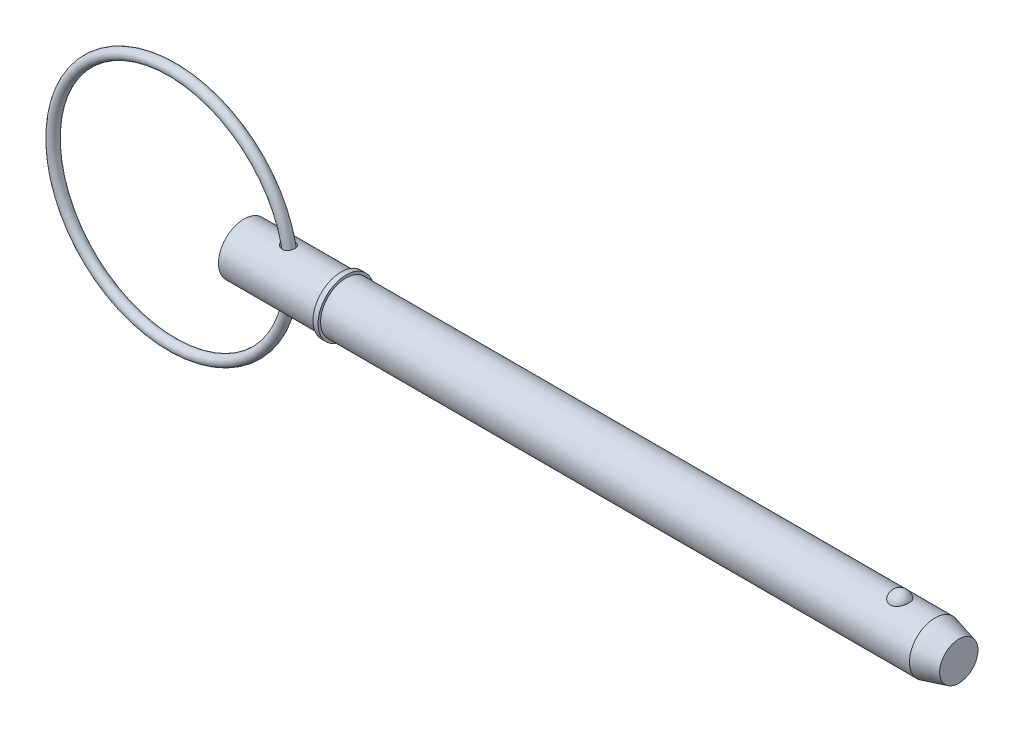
ISO-10303-21;
HEADER;
FILE_DESCRIPTION(('STEP AP214'),'2;1');
FILE_NAME('part.step','',(''),(''),'','','');
FILE_SCHEMA(('AUTOMOTIVE_DESIGN { 1 0 10303 214 1 1 1 1 }'));
ENDSEC;
DATA;
#1=APPLICATION_CONTEXT('core data for automotive mechanical design processes');
#2=APPLICATION_PROTOCOL_DEFINITION('international standard','automotive_design',2000,#1);
#3=PRODUCT_CONTEXT('',#1,'mechanical');
#4=PRODUCT('Part','Part','',(#3));
#5=PRODUCT_RELATED_PRODUCT_CATEGORY('part','',(#4));
#6=PRODUCT_DEFINITION_FORMATION('','',#4);
#7=PRODUCT_DEFINITION_CONTEXT('part definition',#1,'design');
#8=PRODUCT_DEFINITION('design','',#6,#7);
#9=PRODUCT_DEFINITION_SHAPE('','',#8);
#10=(LENGTH_UNIT() NAMED_UNIT(*) SI_UNIT(.MILLI.,.METRE.));
#11=(NAMED_UNIT(*) PLANE_ANGLE_UNIT() SI_UNIT($,.RADIAN.));
#12=(NAMED_UNIT(*) SI_UNIT($,.STERADIAN.) SOLID_ANGLE_UNIT());
#13=UNCERTAINTY_MEASURE_WITH_UNIT(LENGTH_MEASURE(1.E-05),#10,'distance_accuracy_value','');
#14=(GEOMETRIC_REPRESENTATION_CONTEXT(3) GLOBAL_UNCERTAINTY_ASSIGNED_CONTEXT((#13)) GLOBAL_UNIT_ASSIGNED_CONTEXT((#10,
#11,#12)) REPRESENTATION_CONTEXT('',''));
#15=CARTESIAN_POINT('',(0.,0.,0.));
#16=DIRECTION('',(0.,0.,1.));
#17=DIRECTION('',(1.,0.,0.));
#18=AXIS2_PLACEMENT_3D('',#15,#16,#17);
#19=CARTESIAN_POINT('',(-13.4013067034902,0.,0.));
#20=DIRECTION('',(0.,0.,1.));
#21=DIRECTION('',(1.,0.,0.));
#22=AXIS2_PLACEMENT_3D('',#19,#20,#21);
#23=TOROIDAL_SURFACE('',#22,22.225,0.952999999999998);
#24=CARTESIAN_POINT('',(9.77669329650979,0.,0.));
#25=VERTEX_POINT('',#24);
#26=VERTEX_LOOP('',#25);
#27=FACE_BOUND('',#26,.T.);
#28=ADVANCED_FACE('P0_F12',(#27),#23,.T.);
#29=CLOSED_SHELL('',(#28));
#30=MANIFOLD_SOLID_BREP('P0_B1',#29);
#31=CARTESIAN_POINT('',(0.,0.,0.));
#32=DIRECTION('',(1.,0.,0.));
#33=DIRECTION('',(0.,0.,-1.));
#34=AXIS2_PLACEMENT_3D('',#31,#32,#33);
#35=CYLINDRICAL_SURFACE('',#34,4.765);
#36=CARTESIAN_POINT('',(7.48459594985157,4.685973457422,-0.864220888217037));
#37=CARTESIAN_POINT('',(7.53849733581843,4.67711144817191,-0.912273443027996));
#38=CARTESIAN_POINT('',(7.59654891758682,4.66833039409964,-0.955745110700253));
#39=CARTESIAN_POINT('',(7.71924602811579,4.65195567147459,-1.03251233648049));
#40=CARTESIAN_POINT('',(7.78389917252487,4.64436340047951,-1.06579596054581));
#41=CARTESIAN_POINT('',(7.91808098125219,4.63129108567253,-1.12124172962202));
#42=CARTESIAN_POINT('',(7.98761280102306,4.62581242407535,-1.14339659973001));
#43=CARTESIAN_POINT('',(8.12956198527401,4.61771699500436,-1.17566870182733));
#44=CARTESIAN_POINT('',(8.20197774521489,4.61509865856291,-1.18579253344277));
#45=CARTESIAN_POINT('',(8.34550810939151,4.6131791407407,-1.19323853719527));
#46=CARTESIAN_POINT('',(8.41660306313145,4.61378793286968,-1.19090812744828));
#47=CARTESIAN_POINT('',(8.55721866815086,4.61812874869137,-1.17396277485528));
#48=CARTESIAN_POINT('',(8.62673979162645,4.62185982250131,-1.15935156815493));
#49=CARTESIAN_POINT('',(8.75801373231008,4.63172632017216,-1.11925454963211));
#50=CARTESIAN_POINT('',(8.81998342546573,4.63771186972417,-1.09443918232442));
#51=CARTESIAN_POINT('',(8.93863698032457,4.65140179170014,-1.03470792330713));
#52=CARTESIAN_POINT('',(8.99532131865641,4.65910600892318,-0.999792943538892));
#53=CARTESIAN_POINT('',(9.10080884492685,4.67519705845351,-0.921583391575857));
#54=CARTESIAN_POINT('',(9.14973848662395,4.68356861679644,-0.878455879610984));
#55=CARTESIAN_POINT('',(9.23971126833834,4.70019813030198,-0.784620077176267));
#56=CARTESIAN_POINT('',(9.28075401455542,4.7084560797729,-0.733911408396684));
#57=CARTESIAN_POINT('',(9.35441071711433,4.7240688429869,-0.62563775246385));
#58=CARTESIAN_POINT('',(9.38691359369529,4.73141115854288,-0.567995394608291));
#59=CARTESIAN_POINT('',(9.44203216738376,4.74427907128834,-0.447974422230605));
#60=CARTESIAN_POINT('',(9.46464743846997,4.74980459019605,-0.385595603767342));
#61=CARTESIAN_POINT('',(9.49961110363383,4.75848927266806,-0.257248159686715));
#62=CARTESIAN_POINT('',(9.51186382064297,4.76162635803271,-0.191251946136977));
#63=CARTESIAN_POINT('',(9.52545294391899,4.76511165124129,-0.0580729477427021));
#64=CARTESIAN_POINT('',(9.52678936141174,4.76545986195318,0.00910983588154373));
#65=CARTESIAN_POINT('',(9.51851557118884,4.76333054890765,0.142723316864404));
#66=CARTESIAN_POINT('',(9.50891008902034,4.76085424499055,0.209154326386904));
#67=CARTESIAN_POINT('',(9.47899306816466,4.75334441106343,0.339411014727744));
#68=CARTESIAN_POINT('',(9.45868126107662,4.74831081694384,0.403236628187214));
#69=CARTESIAN_POINT('',(9.4078294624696,4.73622777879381,0.526509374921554));
#70=CARTESIAN_POINT('',(9.37728413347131,4.72917728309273,0.585954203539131));
#71=CARTESIAN_POINT('',(9.30671117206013,4.71383320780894,0.698745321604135));
#72=CARTESIAN_POINT('',(9.26668347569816,4.70553961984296,0.752091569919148));
#73=CARTESIAN_POINT('',(9.17821531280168,4.68864637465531,0.851083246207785));
#74=CARTESIAN_POINT('',(9.12978756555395,4.68004719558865,0.896740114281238));
#75=CARTESIAN_POINT('',(9.02575872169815,4.66350833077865,0.97912505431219));
#76=CARTESIAN_POINT('',(8.97015856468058,4.65556855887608,1.01585429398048));
#77=CARTESIAN_POINT('',(8.85409306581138,4.6413534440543,1.0789347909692));
#78=CARTESIAN_POINT('',(8.79369898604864,4.63505812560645,1.10541268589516));
#79=CARTESIAN_POINT('',(8.66918290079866,4.62469916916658,1.1479836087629));
#80=CARTESIAN_POINT('',(8.60506121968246,4.62063533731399,1.1640775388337));
#81=CARTESIAN_POINT('',(8.47537782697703,4.61517348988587,1.18554696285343));
#82=CARTESIAN_POINT('',(8.4098281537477,4.61375835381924,1.19099130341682));
#83=CARTESIAN_POINT('',(8.2786938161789,4.61362908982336,1.19149080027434));
#84=CARTESIAN_POINT('',(8.21310914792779,4.61491539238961,1.18654430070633));
#85=CARTESIAN_POINT('',(8.08152457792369,4.62006017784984,1.16635311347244));
#86=CARTESIAN_POINT('',(8.01557748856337,4.62399895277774,1.15078675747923));
#87=CARTESIAN_POINT('',(7.88704537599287,4.63403793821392,1.10966738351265));
#88=CARTESIAN_POINT('',(7.82446148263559,4.64013886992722,1.08411103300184));
#89=CARTESIAN_POINT('',(7.70057947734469,4.65423592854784,1.02195168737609));
#90=CARTESIAN_POINT('',(7.63957197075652,4.66232221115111,0.984788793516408));
#91=CARTESIAN_POINT('',(7.52457021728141,4.67924552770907,0.900950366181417));
#92=CARTESIAN_POINT('',(7.47057819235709,4.68808279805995,0.854271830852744));
#93=CARTESIAN_POINT('',(7.37028930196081,4.70567913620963,0.751386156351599));
#94=CARTESIAN_POINT('',(7.32416327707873,4.7144333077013,0.695010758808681));
#95=CARTESIAN_POINT('',(7.24276674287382,4.73060166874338,0.574719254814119));
#96=CARTESIAN_POINT('',(7.20749051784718,4.73801656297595,0.510807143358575));
#97=CARTESIAN_POINT('',(7.15148495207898,4.75009927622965,0.381705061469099));
#98=CARTESIAN_POINT('',(7.12994463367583,4.7549169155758,0.31688231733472));
#99=CARTESIAN_POINT('',(7.09904467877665,4.76189692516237,0.184270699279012));
#100=CARTESIAN_POINT('',(7.08967554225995,4.76406136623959,0.116484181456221));
#101=CARTESIAN_POINT('',(7.08394150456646,4.76538257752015,-0.0133529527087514));
#102=CARTESIAN_POINT('',(7.0864533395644,4.76479916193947,-0.0753538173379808));
#103=CARTESIAN_POINT('',(7.10181380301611,4.76127985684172,-0.197993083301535));
#104=CARTESIAN_POINT('',(7.11466291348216,4.75834385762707,-0.258631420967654));
#105=CARTESIAN_POINT('',(7.14973937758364,4.75051877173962,-0.375744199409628));
#106=CARTESIAN_POINT('',(7.17178938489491,4.7456667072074,-0.432274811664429));
#107=CARTESIAN_POINT('',(7.22432962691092,4.73449674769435,-0.54107038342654));
#108=CARTESIAN_POINT('',(7.25481702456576,4.72817934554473,-0.593336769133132));
#109=CARTESIAN_POINT('',(7.31700895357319,4.71588241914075,-0.683642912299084));
#110=CARTESIAN_POINT('',(7.34750058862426,4.7100477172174,-0.722547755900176));
#111=CARTESIAN_POINT('',(7.41288050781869,4.69812059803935,-0.796421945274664));
#112=CARTESIAN_POINT('',(7.44776960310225,4.69202813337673,-0.831390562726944));
#113=CARTESIAN_POINT('',(7.48459594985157,4.685973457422,-0.864220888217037));
#114=B_SPLINE_CURVE_WITH_KNOTS('',3,(#36,#37,#38,#39,#40,#41,#42,#43,#44,#45,#46,#47,#48,#49,
#50,#51,#52,#53,#54,#55,#56,#57,#58,#59,#60,#61,#62,#63,#64,#65,#66,#67,#68,#69,#70,#71,#72,#73,
#74,#75,#76,#77,#78,#79,#80,#81,#82,#83,#84,#85,#86,#87,#88,#89,#90,#91,#92,#93,#94,#95,#96,#97,
#98,#99,#100,#101,#102,#103,#104,#105,#106,#107,#108,#109,#110,#111,#112,#113),.UNSPECIFIED.,
.T.,.F.,(4,2,2,2,2,2,2,2,2,2,2,2,2,2,2,2,2,2,2,2,2,2,2,2,2,2,2,2,2,2,2,2,2,2,2,2,2,2,4),(0.,
0.218078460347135,0.436411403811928,0.654886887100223,0.873242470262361,1.08553925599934,
1.2977714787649,1.49785367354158,1.6979178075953,1.8942789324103,2.09064985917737,
2.28946102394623,2.48828075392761,2.68891673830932,2.88955251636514,3.09010167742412,
3.29065586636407,3.49131482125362,3.69197512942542,3.89233421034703,4.09266707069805,
4.29043955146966,4.48819484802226,4.68466743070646,4.8811713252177,5.08390806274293,
5.28671248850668,5.50140943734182,5.71617422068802,5.93513249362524,6.15397522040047,
6.35827356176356,6.56241234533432,6.74765856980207,6.93291343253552,7.11475139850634,
7.29652829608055,7.44549570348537,7.59449062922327),.UNSPECIFIED.);
#115=CARTESIAN_POINT('',(7.48459594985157,4.685973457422,-0.864220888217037));
#116=VERTEX_POINT('',#115);
#117=EDGE_CURVE('P1_E42',#116,#116,#114,.T.);
#118=ORIENTED_EDGE('',*,*,#117,.T.);
#119=EDGE_LOOP('',(#118));
#120=FACE_BOUND('',#119,.T.);
#121=CARTESIAN_POINT('',(0.,0.,0.));
#122=DIRECTION('',(1.,0.,0.));
#123=DIRECTION('',(0.,0.,-1.));
#124=AXIS2_PLACEMENT_3D('',#121,#122,#123);
#125=CIRCLE('',#124,4.765);
#126=CARTESIAN_POINT('',(0.,0.,-4.765));
#127=VERTEX_POINT('',#126);
#128=EDGE_CURVE('P1_E9',#127,#127,#125,.T.);
#129=ORIENTED_EDGE('',*,*,#128,.T.);
#130=EDGE_LOOP('',(#129));
#131=FACE_BOUND('',#130,.T.);
#132=CARTESIAN_POINT('',(18.097,0.,0.));
#133=DIRECTION('',(1.,0.,0.));
#134=DIRECTION('',(0.,0.,-1.));
#135=AXIS2_PLACEMENT_3D('',#132,#133,#134);
#136=CIRCLE('',#135,4.765);
#137=CARTESIAN_POINT('',(18.097,0.,-4.765));
#138=VERTEX_POINT('',#137);
#139=EDGE_CURVE('P1_E25',#138,#138,#136,.T.);
#140=ORIENTED_EDGE('',*,*,#139,.F.);
#141=EDGE_LOOP('',(#140));
#142=FACE_BOUND('',#141,.T.);
#143=CARTESIAN_POINT('',(7.48459594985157,-4.685973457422,-0.864220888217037));
#144=CARTESIAN_POINT('',(7.43440944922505,-4.6942250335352,-0.819477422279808));
#145=CARTESIAN_POINT('',(7.38778663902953,-4.70255210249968,-0.77073361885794));
#146=CARTESIAN_POINT('',(7.3030968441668,-4.7184989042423,-0.666172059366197));
#147=CARTESIAN_POINT('',(7.26503010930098,-4.72611861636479,-0.610354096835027));
#148=CARTESIAN_POINT('',(7.19878266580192,-4.73983819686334,-0.492624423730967));
#149=CARTESIAN_POINT('',(7.17064194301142,-4.74593188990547,-0.430689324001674));
#150=CARTESIAN_POINT('',(7.12584349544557,-4.75581281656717,-0.3026233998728));
#151=CARTESIAN_POINT('',(7.10917889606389,-4.75960143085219,-0.236495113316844));
#152=CARTESIAN_POINT('',(7.0889853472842,-4.76421379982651,-0.106818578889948));
#153=CARTESIAN_POINT('',(7.0846333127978,-4.76522320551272,-0.0434047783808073));
#154=CARTESIAN_POINT('',(7.08693064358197,-4.7646936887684,0.0832041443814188));
#155=CARTESIAN_POINT('',(7.09357756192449,-4.76315533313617,0.146399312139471));
#156=CARTESIAN_POINT('',(7.11694629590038,-4.75784365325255,0.267709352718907));
#157=CARTESIAN_POINT('',(7.13318365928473,-4.75417793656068,0.325923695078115));
#158=CARTESIAN_POINT('',(7.17459606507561,-4.74508048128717,0.438922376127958));
#159=CARTESIAN_POINT('',(7.19977257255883,-4.73964845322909,0.493706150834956));
#160=CARTESIAN_POINT('',(7.25946789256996,-4.72725615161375,0.60111049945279));
#161=CARTESIAN_POINT('',(7.2943661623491,-4.72023663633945,0.653512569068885));
#162=CARTESIAN_POINT('',(7.37173226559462,-4.70550732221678,0.752279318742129));
#163=CARTESIAN_POINT('',(7.41420315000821,-4.69779724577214,0.798641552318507));
#164=CARTESIAN_POINT('',(7.50982312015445,-4.6816641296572,0.888551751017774));
#165=CARTESIAN_POINT('',(7.56359853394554,-4.67324162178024,0.931434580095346));
#166=CARTESIAN_POINT('',(7.67736628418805,-4.65728554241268,1.00819498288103));
#167=CARTESIAN_POINT('',(7.7373611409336,-4.64975233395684,1.04206888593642));
#168=CARTESIAN_POINT('',(7.86574076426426,-4.63599923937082,1.10169445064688));
#169=CARTESIAN_POINT('',(7.93441048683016,-4.62988111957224,1.12685968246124));
#170=CARTESIAN_POINT('',(8.07519000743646,-4.62035710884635,1.16529928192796));
#171=CARTESIAN_POINT('',(8.14729925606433,-4.61695078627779,1.1785755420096));
#172=CARTESIAN_POINT('',(8.29111621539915,-4.61341807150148,1.19232949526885));
#173=CARTESIAN_POINT('',(8.36279361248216,-4.61321655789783,1.19310032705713));
#174=CARTESIAN_POINT('',(8.50512944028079,-4.61602317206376,1.1821962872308));
#175=CARTESIAN_POINT('',(8.57578827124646,-4.61903000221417,1.17052644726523));
#176=CARTESIAN_POINT('',(8.70965757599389,-4.62766311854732,1.13589249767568));
#177=CARTESIAN_POINT('',(8.77306169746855,-4.63312492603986,1.11363308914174));
#178=CARTESIAN_POINT('',(8.8949702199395,-4.64598463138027,1.05869880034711));
#179=CARTESIAN_POINT('',(8.95347516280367,-4.65338231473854,1.02602507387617));
#180=CARTESIAN_POINT('',(9.06253415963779,-4.66906009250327,0.952097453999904));
#181=CARTESIAN_POINT('',(9.11324728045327,-4.67731427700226,0.911072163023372));
#182=CARTESIAN_POINT('',(9.20707850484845,-4.69393979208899,0.821122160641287));
#183=CARTESIAN_POINT('',(9.25019629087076,-4.70231112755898,0.772197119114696));
#184=CARTESIAN_POINT('',(9.32819072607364,-4.71835356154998,0.667239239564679));
#185=CARTESIAN_POINT('',(9.36297449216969,-4.72601623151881,0.611136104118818));
#186=CARTESIAN_POINT('',(9.42286382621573,-4.73971239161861,0.493799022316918));
#187=CARTESIAN_POINT('',(9.44796891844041,-4.74574580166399,0.432564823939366));
#188=CARTESIAN_POINT('',(9.48811605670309,-4.75559286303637,0.305990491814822));
#189=CARTESIAN_POINT('',(9.50304870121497,-4.75938232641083,0.240613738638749));
#190=CARTESIAN_POINT('',(9.5220569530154,-4.76423188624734,0.108201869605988));
#191=CARTESIAN_POINT('',(9.52613255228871,-4.76529198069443,0.0411667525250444));
#192=CARTESIAN_POINT('',(9.52332772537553,-4.76456884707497,-0.0926701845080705));
#193=CARTESIAN_POINT('',(9.51644541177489,-4.76278512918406,-0.159471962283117));
#194=CARTESIAN_POINT('',(9.49188827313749,-4.75656536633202,-0.290934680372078));
#195=CARTESIAN_POINT('',(9.47421322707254,-4.75212926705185,-0.355595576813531));
#196=CARTESIAN_POINT('',(9.42849503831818,-4.74108318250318,-0.480955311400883));
#197=CARTESIAN_POINT('',(9.4004503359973,-4.73447287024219,-0.541653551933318));
#198=CARTESIAN_POINT('',(9.33467290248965,-4.71979928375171,-0.657361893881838));
#199=CARTESIAN_POINT('',(9.29694000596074,-4.71173598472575,-0.712371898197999));
#200=CARTESIAN_POINT('',(9.2127449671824,-4.69505469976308,-0.815106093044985));
#201=CARTESIAN_POINT('',(9.1662875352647,-4.68643701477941,-0.862834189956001));
#202=CARTESIAN_POINT('',(9.06584125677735,-4.66961864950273,-0.949656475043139));
#203=CARTESIAN_POINT('',(9.01185326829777,-4.66141792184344,-0.98875164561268));
#204=CARTESIAN_POINT('',(8.8985010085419,-4.64646376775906,-1.0567894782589));
#205=CARTESIAN_POINT('',(8.83920621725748,-4.63969468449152,-1.08584444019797));
#206=CARTESIAN_POINT('',(8.71642097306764,-4.62824519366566,-1.13365785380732));
#207=CARTESIAN_POINT('',(8.65293102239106,-4.623564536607,-1.15241753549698));
#208=CARTESIAN_POINT('',(8.52421291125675,-4.61681938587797,-1.17914952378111));
#209=CARTESIAN_POINT('',(8.45900634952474,-4.6147310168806,-1.18722032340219));
#210=CARTESIAN_POINT('',(8.32811210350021,-4.61325848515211,-1.19292878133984));
#211=CARTESIAN_POINT('',(8.26242433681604,-4.61387479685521,-1.19056460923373));
#212=CARTESIAN_POINT('',(8.13057358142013,-4.6177227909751,-1.17555160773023));
#213=CARTESIAN_POINT('',(8.06444352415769,-4.62102282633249,-1.16263394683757));
#214=CARTESIAN_POINT('',(7.93513143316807,-4.62989870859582,-1.12676570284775));
#215=CARTESIAN_POINT('',(7.87194976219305,-4.6354748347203,-1.10381388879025));
#216=CARTESIAN_POINT('',(7.75155849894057,-4.64811746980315,-1.04928030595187));
#217=CARTESIAN_POINT('',(7.69423767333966,-4.65514232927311,-1.01793362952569));
#218=CARTESIAN_POINT('',(7.58503138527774,-4.67007903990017,-0.947046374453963));
#219=CARTESIAN_POINT('',(7.53314612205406,-4.67799092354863,-0.907505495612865));
#220=CARTESIAN_POINT('',(7.48459594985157,-4.685973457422,-0.864220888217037));
#221=B_SPLINE_CURVE_WITH_KNOTS('',3,(#143,#144,#145,#146,#147,#148,#149,#150,#151,#152,#153,
#154,#155,#156,#157,#158,#159,#160,#161,#162,#163,#164,#165,#166,#167,#168,#169,#170,#171,#172,
#173,#174,#175,#176,#177,#178,#179,#180,#181,#182,#183,#184,#185,#186,#187,#188,#189,#190,#191,
#192,#193,#194,#195,#196,#197,#198,#199,#200,#201,#202,#203,#204,#205,#206,#207,#208,#209,#210,
#211,#212,#213,#214,#215,#216,#217,#218,#219,#220),.UNSPECIFIED.,.T.,.F.,(4,2,2,2,2,2,2,2,2,2,2,
2,2,2,2,2,2,2,2,2,2,2,2,2,2,2,2,2,2,2,2,2,2,2,2,2,2,2,4),(0.,0.203013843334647,
0.406033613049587,0.609862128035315,0.813568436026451,1.0032929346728,1.19297523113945,
1.37380897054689,1.55467236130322,1.74393241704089,1.93326889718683,2.14025373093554,
2.3473227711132,2.566425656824,2.78549366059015,2.9994188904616,3.21325763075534,
3.41451842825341,3.61575693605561,3.81208930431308,4.00842987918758,4.20686629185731,
4.40531245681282,4.60586051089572,4.80640871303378,5.0069914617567,5.20757831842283,
5.40819535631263,5.60881581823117,5.80932827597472,6.00981790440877,6.2079863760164,
6.40613116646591,6.60243714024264,6.79877754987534,7.00028133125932,7.20180983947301,
7.39819723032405,7.59459181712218),.UNSPECIFIED.);
#222=CARTESIAN_POINT('',(7.48459594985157,-4.685973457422,-0.864220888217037));
#223=VERTEX_POINT('',#222);
#224=EDGE_CURVE('P1_E17',#223,#223,#221,.T.);
#225=ORIENTED_EDGE('',*,*,#224,.T.);
#226=EDGE_LOOP('',(#225));
#227=FACE_BOUND('',#226,.T.);
#228=ADVANCED_FACE('P1_F13',(#120,#131,#142,#227),#35,.T.);
#229=CARTESIAN_POINT('',(0.,0.,0.));
#230=DIRECTION('',(1.,0.,0.));
#231=DIRECTION('',(0.,0.,-1.));
#232=AXIS2_PLACEMENT_3D('',#229,#230,#231);
#233=CYLINDRICAL_SURFACE('',#232,4.765);
#234=CARTESIAN_POINT('',(128.904194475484,0.,0.));
#235=DIRECTION('',(1.,0.,0.));
#236=DIRECTION('',(0.,0.,-1.));
#237=AXIS2_PLACEMENT_3D('',#234,#235,#236);
#238=CIRCLE('',#237,4.765);
#239=CARTESIAN_POINT('',(128.904194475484,0.,-4.765));
#240=VERTEX_POINT('',#239);
#241=EDGE_CURVE('P1_E99',#240,#240,#238,.T.);
#242=ORIENTED_EDGE('',*,*,#241,.F.);
#243=EDGE_LOOP('',(#242));
#244=FACE_BOUND('',#243,.T.);
#245=CARTESIAN_POINT('',(19.05,0.,0.));
#246=DIRECTION('',(1.,0.,0.));
#247=DIRECTION('',(0.,0.,-1.));
#248=AXIS2_PLACEMENT_3D('',#245,#246,#247);
#249=CIRCLE('',#248,4.765);
#250=CARTESIAN_POINT('',(19.05,0.,-4.765));
#251=VERTEX_POINT('',#250);
#252=EDGE_CURVE('P1_E96',#251,#251,#249,.T.);
#253=ORIENTED_EDGE('',*,*,#252,.T.);
#254=EDGE_LOOP('',(#253));
#255=FACE_BOUND('',#254,.T.);
#256=CARTESIAN_POINT('',(122.351020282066,4.42764777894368,1.76101111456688));
#257=CARTESIAN_POINT('',(122.259721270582,4.42764470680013,1.76101422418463));
#258=CARTESIAN_POINT('',(122.168446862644,4.43059091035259,1.75366340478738));
#259=CARTESIAN_POINT('',(121.988615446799,4.44201846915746,1.72451180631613));
#260=CARTESIAN_POINT('',(121.900057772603,4.45049845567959,1.70271460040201));
#261=CARTESIAN_POINT('',(121.728257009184,4.47200516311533,1.6453937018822));
#262=CARTESIAN_POINT('',(121.645006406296,4.48502527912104,1.60988994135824));
#263=CARTESIAN_POINT('',(121.485763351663,4.51419542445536,1.52617873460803));
#264=CARTESIAN_POINT('',(121.409772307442,4.53034605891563,1.47796883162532));
#265=CARTESIAN_POINT('',(121.264744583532,4.5645931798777,1.36860494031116));
#266=CARTESIAN_POINT('',(121.195964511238,4.58273170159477,1.30712420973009));
#267=CARTESIAN_POINT('',(121.069342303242,4.61870302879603,1.1737020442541));
#268=CARTESIAN_POINT('',(121.011502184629,4.63653577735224,1.1017586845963));
#269=CARTESIAN_POINT('',(120.905570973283,4.67090140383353,0.945806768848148));
#270=CARTESIAN_POINT('',(120.858030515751,4.68734068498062,0.861402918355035));
#271=CARTESIAN_POINT('',(120.777081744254,4.71628466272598,0.68544236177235));
#272=CARTESIAN_POINT('',(120.743674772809,4.72878898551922,0.59388497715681));
#273=CARTESIAN_POINT('',(120.691287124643,4.74874061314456,0.404781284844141));
#274=CARTESIAN_POINT('',(120.672517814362,4.75611366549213,0.307168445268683));
#275=CARTESIAN_POINT('',(120.650584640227,4.76475393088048,0.109940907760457));
#276=CARTESIAN_POINT('',(120.647420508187,4.76602124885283,0.010326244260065));
#277=CARTESIAN_POINT('',(120.656740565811,4.76232928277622,-0.18762912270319));
#278=CARTESIAN_POINT('',(120.669158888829,4.7573962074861,-0.285973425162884));
#279=CARTESIAN_POINT('',(120.709280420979,4.74184975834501,-0.479027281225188));
#280=CARTESIAN_POINT('',(120.736983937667,4.7312362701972,-0.573736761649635));
#281=CARTESIAN_POINT('',(120.807158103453,4.70540026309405,-0.756973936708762));
#282=CARTESIAN_POINT('',(120.849646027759,4.69017235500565,-0.845494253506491));
#283=CARTESIAN_POINT('',(120.948520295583,4.6566986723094,-1.01378033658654));
#284=CARTESIAN_POINT('',(121.004907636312,4.63845268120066,-1.09354547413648));
#285=CARTESIAN_POINT('',(121.130552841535,4.60085438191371,-1.24228523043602));
#286=CARTESIAN_POINT('',(121.199843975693,4.58149930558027,-1.31123108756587));
#287=CARTESIAN_POINT('',(121.349606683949,4.54391653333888,-1.43607409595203));
#288=CARTESIAN_POINT('',(121.430077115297,4.52568872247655,-1.49197257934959));
#289=CARTESIAN_POINT('',(121.598150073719,4.49293007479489,-1.58786764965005));
#290=CARTESIAN_POINT('',(121.685544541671,4.47832346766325,-1.62820219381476));
#291=CARTESIAN_POINT('',(121.866553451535,4.45406011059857,-1.69345757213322));
#292=CARTESIAN_POINT('',(121.96016555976,4.44440151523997,-1.71838415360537));
#293=CARTESIAN_POINT('',(122.145893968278,4.43159888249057,-1.75112843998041));
#294=CARTESIAN_POINT('',(122.237849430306,4.42815213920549,-1.75974223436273));
#295=CARTESIAN_POINT('',(122.421965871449,4.427247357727,-1.76201865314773));
#296=CARTESIAN_POINT('',(122.514126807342,4.42978816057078,-1.7556841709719));
#297=CARTESIAN_POINT('',(122.693129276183,4.4403864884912,-1.72869560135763));
#298=CARTESIAN_POINT('',(122.780047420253,4.44827555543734,-1.70847853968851));
#299=CARTESIAN_POINT('',(122.949131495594,4.46852246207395,-1.65479562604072));
#300=CARTESIAN_POINT('',(123.031297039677,4.48088066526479,-1.62132869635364));
#301=CARTESIAN_POINT('',(123.190591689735,4.50907357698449,-1.54120560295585));
#302=CARTESIAN_POINT('',(123.267570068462,4.52497884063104,-1.49427526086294));
#303=CARTESIAN_POINT('',(123.412708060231,4.55845148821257,-1.38881222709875));
#304=CARTESIAN_POINT('',(123.480865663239,4.57601924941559,-1.33027689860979));
#305=CARTESIAN_POINT('',(123.610099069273,4.61196537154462,-1.19991049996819));
#306=CARTESIAN_POINT('',(123.670656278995,4.63034074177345,-1.12756415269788));
#307=CARTESIAN_POINT('',(123.779279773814,4.66513959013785,-0.973612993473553));
#308=CARTESIAN_POINT('',(123.827343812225,4.68156271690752,-0.892006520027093));
#309=CARTESIAN_POINT('',(123.911383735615,4.71130224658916,-0.718892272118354));
#310=CARTESIAN_POINT('',(123.946918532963,4.724501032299,-0.627149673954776));
#311=CARTESIAN_POINT('',(124.002952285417,4.74571823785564,-0.438611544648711));
#312=CARTESIAN_POINT('',(124.023450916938,4.75373654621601,-0.341815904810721));
#313=CARTESIAN_POINT('',(124.049033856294,4.76378905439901,-0.145633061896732));
#314=CARTESIAN_POINT('',(124.054076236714,4.76580697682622,-0.0462395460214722));
#315=CARTESIAN_POINT('',(124.048523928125,4.76360573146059,0.15203857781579));
#316=CARTESIAN_POINT('',(124.037929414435,4.75938663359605,0.250923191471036));
#317=CARTESIAN_POINT('',(124.001387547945,4.74516937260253,0.445004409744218));
#318=CARTESIAN_POINT('',(123.975496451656,4.73519238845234,0.540213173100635));
#319=CARTESIAN_POINT('',(123.908927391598,4.7104939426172,0.724662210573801));
#320=CARTESIAN_POINT('',(123.868248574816,4.69577220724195,0.813902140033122));
#321=CARTESIAN_POINT('',(123.772717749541,4.66303767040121,0.984313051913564));
#322=CARTESIAN_POINT('',(123.717804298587,4.64501070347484,1.06544688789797));
#323=CARTESIAN_POINT('',(123.595049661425,4.60764678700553,1.21692673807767));
#324=CARTESIAN_POINT('',(123.527208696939,4.58830985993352,1.2872729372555));
#325=CARTESIAN_POINT('',(123.380548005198,4.55060370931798,1.41479271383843));
#326=CARTESIAN_POINT('',(123.301791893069,4.53222967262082,1.47203785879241));
#327=CARTESIAN_POINT('',(123.134989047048,4.49849576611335,1.57212016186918));
#328=CARTESIAN_POINT('',(123.046941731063,4.48313608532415,1.61495641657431));
#329=CARTESIAN_POINT('',(122.859791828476,4.45676184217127,1.68642657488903));
#330=CARTESIAN_POINT('',(122.760365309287,4.44598302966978,1.71430590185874));
#331=CARTESIAN_POINT('',(122.557621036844,4.43142918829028,1.7515925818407));
#332=CARTESIAN_POINT('',(122.454304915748,4.42765125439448,1.76100759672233));
#333=CARTESIAN_POINT('',(122.351020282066,4.42764777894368,1.76101111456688));
#334=B_SPLINE_CURVE_WITH_KNOTS('',3,(#256,#257,#258,#259,#260,#261,#262,#263,#264,#265,#266,
#267,#268,#269,#270,#271,#272,#273,#274,#275,#276,#277,#278,#279,#280,#281,#282,#283,#284,#285,
#286,#287,#288,#289,#290,#291,#292,#293,#294,#295,#296,#297,#298,#299,#300,#301,#302,#303,#304,
#305,#306,#307,#308,#309,#310,#311,#312,#313,#314,#315,#316,#317,#318,#319,#320,#321,#322,#323,
#324,#325,#326,#327,#328,#329,#330,#331,#332,#333),.UNSPECIFIED.,.T.,.F.,(4,2,2,2,2,2,2,2,2,2,2,
2,2,2,2,2,2,2,2,2,2,2,2,2,2,2,2,2,2,2,2,2,2,2,2,2,2,2,4),(0.,0.273517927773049,
0.546968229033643,0.820022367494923,1.09312934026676,1.37393946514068,1.65480131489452,
1.94820420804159,2.24163496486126,2.53922817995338,2.8368162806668,3.13315071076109,
3.42949110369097,3.72617893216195,4.02288805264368,4.32037303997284,4.61782764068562,
4.90840095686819,5.19886582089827,5.47474855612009,5.75057789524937,6.01809977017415,
6.28564340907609,6.55907787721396,6.83257454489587,7.11962987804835,7.40673679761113,
7.70312663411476,7.99952284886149,8.29672237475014,8.59391856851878,8.89002850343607,
9.18615552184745,9.48358266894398,9.78100471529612,10.0767610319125,10.3725358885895,
10.6820893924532,10.991514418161),.UNSPECIFIED.);
#335=CARTESIAN_POINT('',(122.351020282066,4.42764777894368,1.76101111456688));
#336=VERTEX_POINT('',#335);
#337=EDGE_CURVE('P1_E34',#336,#336,#334,.T.);
#338=ORIENTED_EDGE('',*,*,#337,.T.);
#339=EDGE_LOOP('',(#338));
#340=FACE_BOUND('',#339,.T.);
#341=ADVANCED_FACE('P1_F46',(#244,#255,#340),#233,.T.);
#342=CARTESIAN_POINT('',(0.,0.,0.));
#343=DIRECTION('',(-1.,0.,0.));
#344=DIRECTION('',(0.,0.,1.));
#345=AXIS2_PLACEMENT_3D('',#342,#343,#344);
#346=PLANE('',#345);
#347=ORIENTED_EDGE('',*,*,#128,.F.);
#348=EDGE_LOOP('',(#347));
#349=FACE_BOUND('',#348,.T.);
#350=ADVANCED_FACE('P1_F15',(#349),#346,.T.);
#351=CARTESIAN_POINT('',(18.097,4.765,0.));
#352=DIRECTION('',(-1.,0.,0.));
#353=DIRECTION('',(0.,0.,1.));
#354=AXIS2_PLACEMENT_3D('',#351,#352,#353);
#355=PLANE('',#354);
#356=ORIENTED_EDGE('',*,*,#139,.T.);
#357=EDGE_LOOP('',(#356));
#358=FACE_BOUND('',#357,.T.);
#359=CARTESIAN_POINT('',(18.097,0.,0.));
#360=DIRECTION('',(1.,0.,0.));
#361=DIRECTION('',(0.,0.,-1.));
#362=AXIS2_PLACEMENT_3D('',#359,#360,#361);
#363=CIRCLE('',#362,5.2415);
#364=CARTESIAN_POINT('',(18.097,0.,-5.2415));
#365=VERTEX_POINT('',#364);
#366=EDGE_CURVE('P1_E30',#365,#365,#363,.T.);
#367=ORIENTED_EDGE('',*,*,#366,.F.);
#368=EDGE_LOOP('',(#367));
#369=FACE_BOUND('',#368,.T.);
#370=ADVANCED_FACE('P1_F81',(#358,#369),#355,.T.);
#371=CARTESIAN_POINT('',(0.,0.,0.));
#372=DIRECTION('',(1.,0.,0.));
#373=DIRECTION('',(0.,0.,-1.));
#374=AXIS2_PLACEMENT_3D('',#371,#372,#373);
#375=CYLINDRICAL_SURFACE('',#374,5.2415);
#376=ORIENTED_EDGE('',*,*,#366,.T.);
#377=EDGE_LOOP('',(#376));
#378=FACE_BOUND('',#377,.T.);
#379=CARTESIAN_POINT('',(19.05,0.,0.));
#380=DIRECTION('',(1.,0.,0.));
#381=DIRECTION('',(0.,0.,-1.));
#382=AXIS2_PLACEMENT_3D('',#379,#380,#381);
#383=CIRCLE('',#382,5.2415);
#384=CARTESIAN_POINT('',(19.05,0.,-5.2415));
#385=VERTEX_POINT('',#384);
#386=EDGE_CURVE('P1_E95',#385,#385,#383,.T.);
#387=ORIENTED_EDGE('',*,*,#386,.F.);
#388=EDGE_LOOP('',(#387));
#389=FACE_BOUND('',#388,.T.);
#390=ADVANCED_FACE('P1_F68',(#378,#389),#375,.T.);
#391=CARTESIAN_POINT('',(19.05,5.2415,0.));
#392=DIRECTION('',(1.,0.,0.));
#393=DIRECTION('',(0.,0.,-1.));
#394=AXIS2_PLACEMENT_3D('',#391,#392,#393);
#395=PLANE('',#394);
#396=ORIENTED_EDGE('',*,*,#386,.T.);
#397=EDGE_LOOP('',(#396));
#398=FACE_BOUND('',#397,.T.);
#399=ORIENTED_EDGE('',*,*,#252,.F.);
#400=EDGE_LOOP('',(#399));
#401=FACE_BOUND('',#400,.T.);
#402=ADVANCED_FACE('P1_F62',(#398,#401),#395,.T.);
#403=CARTESIAN_POINT('',(133.35,0.,0.));
#404=DIRECTION('',(-1.,0.,0.));
#405=DIRECTION('',(0.,0.,1.));
#406=AXIS2_PLACEMENT_3D('',#403,#404,#405);
#407=CONICAL_SURFACE('',#406,3.57375000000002,0.261799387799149);
#408=ORIENTED_EDGE('',*,*,#241,.T.);
#409=EDGE_LOOP('',(#408));
#410=FACE_BOUND('',#409,.T.);
#411=CARTESIAN_POINT('',(133.35,0.,0.));
#412=DIRECTION('',(1.,0.,0.));
#413=DIRECTION('',(0.,0.,-1.));
#414=AXIS2_PLACEMENT_3D('',#411,#412,#413);
#415=CIRCLE('',#414,3.57375000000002);
#416=CARTESIAN_POINT('',(133.35,0.,-3.57375000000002));
#417=VERTEX_POINT('',#416);
#418=EDGE_CURVE('P1_E41',#417,#417,#415,.T.);
#419=ORIENTED_EDGE('',*,*,#418,.F.);
#420=EDGE_LOOP('',(#419));
#421=FACE_BOUND('',#420,.T.);
#422=ADVANCED_FACE('P1_F59',(#410,#421),#407,.T.);
#423=CARTESIAN_POINT('',(133.35,3.57375000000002,0.));
#424=DIRECTION('',(1.,0.,0.));
#425=DIRECTION('',(0.,0.,-1.));
#426=AXIS2_PLACEMENT_3D('',#423,#424,#425);
#427=PLANE('',#426);
#428=ORIENTED_EDGE('',*,*,#418,.T.);
#429=EDGE_LOOP('',(#428));
#430=FACE_BOUND('',#429,.T.);
#431=ADVANCED_FACE('P1_F55',(#430),#427,.T.);
#432=CARTESIAN_POINT('',(122.351020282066,4.28849999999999,0.));
#433=DIRECTION('',(-1.,0.,0.));
#434=DIRECTION('',(0.,1.,0.));
#435=AXIS2_PLACEMENT_3D('',#432,#433,#434);
#436=SPHERICAL_SURFACE('',#435,1.7665);
#437=ORIENTED_EDGE('',*,*,#337,.F.);
#438=EDGE_LOOP('',(#437));
#439=FACE_BOUND('',#438,.T.);
#440=ADVANCED_FACE('P1_F50',(#439),#436,.T.);
#441=CARTESIAN_POINT('',(-13.4013067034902,0.,0.));
#442=DIRECTION('',(0.,0.,1.));
#443=DIRECTION('',(1.,0.,0.));
#444=AXIS2_PLACEMENT_3D('',#441,#442,#443);
#445=TOROIDAL_SURFACE('',#444,22.225,1.19125);
#446=ORIENTED_EDGE('',*,*,#224,.F.);
#447=EDGE_LOOP('',(#446));
#448=FACE_BOUND('',#447,.T.);
#449=ORIENTED_EDGE('',*,*,#117,.F.);
#450=EDGE_LOOP('',(#449));
#451=FACE_BOUND('',#450,.T.);
#452=ADVANCED_FACE('P1_F54',(#448,#451),#445,.F.);
#453=CLOSED_SHELL('',(#228,#341,#350,#370,#390,#402,#422,#431,#440,#452));
#454=MANIFOLD_SOLID_BREP('P1_B1',#453);
#455=ADVANCED_BREP_SHAPE_REPRESENTATION('',(#18,#30,#454),#14);
#456=SHAPE_DEFINITION_REPRESENTATION(#9,#455);
ENDSEC;
END-ISO-10303-21;
